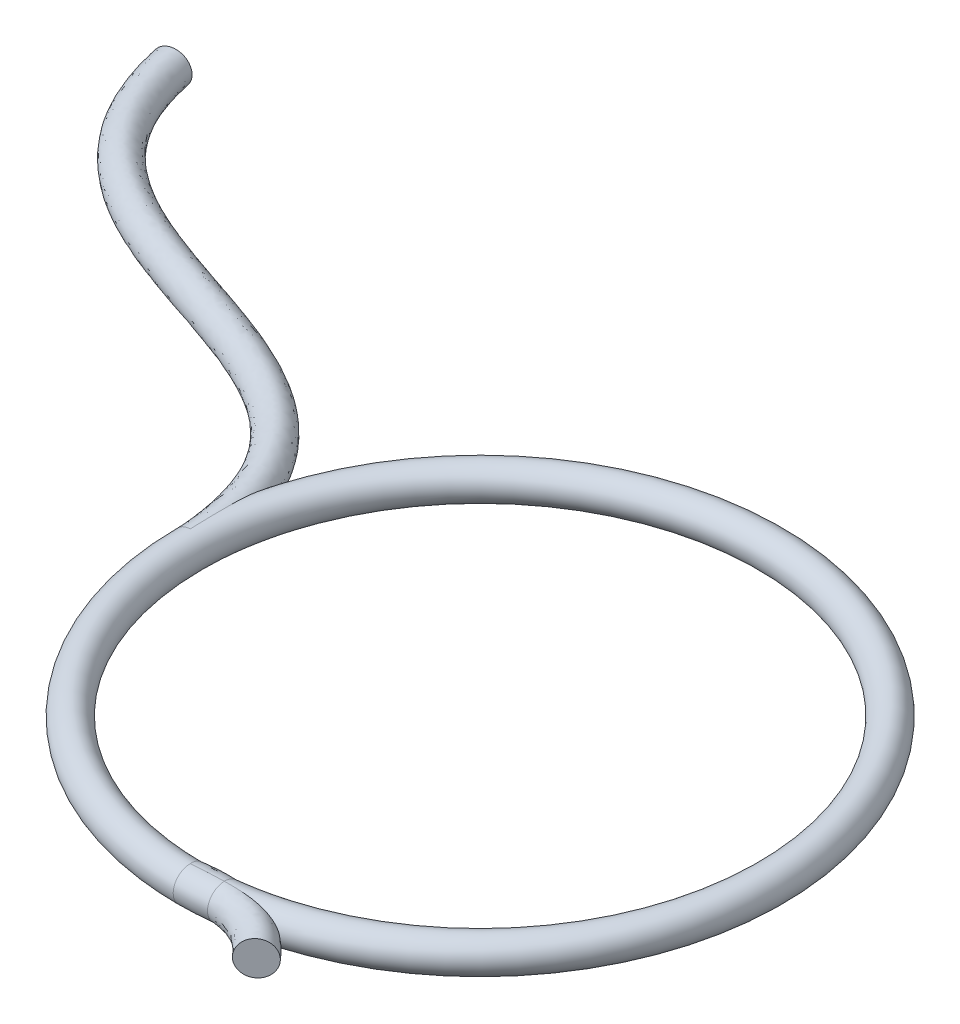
ISO-10303-21;
HEADER;
FILE_DESCRIPTION(('STEP AP214'),'2;1');
FILE_NAME('part.step','',(''),(''),'','','');
FILE_SCHEMA(('AUTOMOTIVE_DESIGN { 1 0 10303 214 1 1 1 1 }'));
ENDSEC;
DATA;
#1=APPLICATION_CONTEXT('core data for automotive mechanical design processes');
#2=APPLICATION_PROTOCOL_DEFINITION('international standard','automotive_design',2000,#1);
#3=PRODUCT_CONTEXT('',#1,'mechanical');
#4=PRODUCT('Part','Part','',(#3));
#5=PRODUCT_RELATED_PRODUCT_CATEGORY('part','',(#4));
#6=PRODUCT_DEFINITION_FORMATION('','',#4);
#7=PRODUCT_DEFINITION_CONTEXT('part definition',#1,'design');
#8=PRODUCT_DEFINITION('design','',#6,#7);
#9=PRODUCT_DEFINITION_SHAPE('','',#8);
#10=(LENGTH_UNIT() NAMED_UNIT(*) SI_UNIT(.MILLI.,.METRE.));
#11=(NAMED_UNIT(*) PLANE_ANGLE_UNIT() SI_UNIT($,.RADIAN.));
#12=(NAMED_UNIT(*) SI_UNIT($,.STERADIAN.) SOLID_ANGLE_UNIT());
#13=UNCERTAINTY_MEASURE_WITH_UNIT(LENGTH_MEASURE(1.E-05),#10,'distance_accuracy_value','');
#14=(GEOMETRIC_REPRESENTATION_CONTEXT(3) GLOBAL_UNCERTAINTY_ASSIGNED_CONTEXT((#13)) GLOBAL_UNIT_ASSIGNED_CONTEXT((#10,
#11,#12)) REPRESENTATION_CONTEXT('',''));
#15=CARTESIAN_POINT('',(0.,0.,0.));
#16=DIRECTION('',(0.,0.,1.));
#17=DIRECTION('',(1.,0.,0.));
#18=AXIS2_PLACEMENT_3D('',#15,#16,#17);
#19=CARTESIAN_POINT('',(0.,0.,0.));
#20=DIRECTION('',(0.,1.,0.));
#21=DIRECTION('',(0.,0.,1.));
#22=AXIS2_PLACEMENT_3D('',#19,#20,#21);
#23=TOROIDAL_SURFACE('',#22,21.59,1.27);
#24=CARTESIAN_POINT('',(0.,-1.27,21.59));
#25=CARTESIAN_POINT('',(0.00582413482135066,-1.26999998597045,21.5895154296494));
#26=CARTESIAN_POINT('',(0.0116483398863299,-1.26999970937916,21.5890316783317));
#27=CARTESIAN_POINT('',(0.227769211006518,-1.26998002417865,21.5711118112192));
#28=CARTESIAN_POINT('',(0.438157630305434,-1.26962984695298,21.5547517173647));
#29=CARTESIAN_POINT('',(0.85913494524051,-1.26908213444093,21.5248400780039));
#30=CARTESIAN_POINT('',(1.06972383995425,-1.26888459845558,21.5112885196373));
#31=CARTESIAN_POINT('',(1.49109422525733,-1.26895251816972,21.4877251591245));
#32=CARTESIAN_POINT('',(1.70187570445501,-1.26921794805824,21.4777131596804));
#33=CARTESIAN_POINT('',(2.01398454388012,-1.26965690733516,21.4660792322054));
#34=CARTESIAN_POINT('',(2.11525120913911,-1.26980648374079,21.4628013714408));
#35=CARTESIAN_POINT('',(2.27390930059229,-1.26995617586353,21.4585090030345));
#36=CARTESIAN_POINT('',(2.33129079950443,-1.26999297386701,21.4571293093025));
#37=CARTESIAN_POINT('',(2.394252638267,-1.26999969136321,21.4558129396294));
#38=CARTESIAN_POINT('',(2.39982935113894,-1.26999999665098,21.4556980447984));
#39=CARTESIAN_POINT('',(2.40540609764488,-1.27,21.4555848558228));
#40=B_SPLINE_CURVE_WITH_KNOTS('',3,(#24,#25,#26,#27,#28,#29,#30,#31,#32,#33,#34,#35,#36,#37,#38,
#39),.UNSPECIFIED.,.F.,.F.,(4,2,2,2,2,2,2,4),(0.,0.0175327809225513,0.650587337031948,
1.28363899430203,1.91665535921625,2.22060980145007,2.39280287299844,2.40953656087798),.UNSPECIFIED.);
#41=CARTESIAN_POINT('',(2.40540609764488,-1.27,21.4555848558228));
#42=VERTEX_POINT('',#41);
#43=CARTESIAN_POINT('',(0.,-1.27,21.59));
#44=VERTEX_POINT('',#43);
#45=EDGE_CURVE('E72',#42,#44,#40,.F.);
#46=ORIENTED_EDGE('',*,*,#45,.F.);
#47=CARTESIAN_POINT('',(2.40540609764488,-1.27,21.4555848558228));
#48=CARTESIAN_POINT('',(2.40552837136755,-1.27000024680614,21.4611604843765));
#49=CARTESIAN_POINT('',(2.40565030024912,-1.26996377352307,21.46673725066));
#50=CARTESIAN_POINT('',(2.40733554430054,-1.26894996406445,21.544050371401));
#51=CARTESIAN_POINT('',(2.4088401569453,-1.26194415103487,21.6158735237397));
#52=CARTESIAN_POINT('',(2.41097196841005,-1.24250246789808,21.7219061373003));
#53=CARTESIAN_POINT('',(2.41166272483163,-1.23451311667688,21.7570214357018));
#54=CARTESIAN_POINT('',(2.41300015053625,-1.21559835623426,21.8264899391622));
#55=CARTESIAN_POINT('',(2.41364678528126,-1.20467067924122,21.8608425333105));
#56=CARTESIAN_POINT('',(2.41551248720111,-1.16763366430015,21.9622001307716));
#57=CARTESIAN_POINT('',(2.41666103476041,-1.13723637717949,22.0276890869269));
#58=CARTESIAN_POINT('',(2.41875623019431,-1.06584474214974,22.1526203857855));
#59=CARTESIAN_POINT('',(2.41970287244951,-1.02485009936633,22.2120625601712));
#60=CARTESIAN_POINT('',(2.42097214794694,-0.956366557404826,22.2953344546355));
#61=CARTESIAN_POINT('',(2.42137006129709,-0.932378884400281,22.3221051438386));
#62=CARTESIAN_POINT('',(2.42211717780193,-0.882253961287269,22.373501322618));
#63=CARTESIAN_POINT('',(2.42246642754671,-0.856118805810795,22.3981288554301));
#64=CARTESIAN_POINT('',(2.42344424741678,-0.774697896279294,22.468576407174));
#65=CARTESIAN_POINT('',(2.42400314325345,-0.71638263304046,22.5109784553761));
#66=CARTESIAN_POINT('',(2.42494787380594,-0.593704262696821,22.5851476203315));
#67=CARTESIAN_POINT('',(2.42533439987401,-0.529366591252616,22.6169570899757));
#68=CARTESIAN_POINT('',(2.42595507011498,-0.396242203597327,22.6692800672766));
#69=CARTESIAN_POINT('',(2.42618922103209,-0.327455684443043,22.6897940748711));
#70=CARTESIAN_POINT('',(2.42651737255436,-0.187688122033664,22.7188565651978));
#71=CARTESIAN_POINT('',(2.42661192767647,-0.116716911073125,22.7274523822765));
#72=CARTESIAN_POINT('',(2.42666861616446,0.0256597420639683,22.7325825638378));
#73=CARTESIAN_POINT('',(2.42663075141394,0.0970651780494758,22.7291170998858));
#74=CARTESIAN_POINT('',(2.42642034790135,0.238137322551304,22.7102426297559));
#75=CARTESIAN_POINT('',(2.42624807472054,0.307807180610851,22.6948571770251));
#76=CARTESIAN_POINT('',(2.42575917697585,0.443573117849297,22.6526281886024));
#77=CARTESIAN_POINT('',(2.42544255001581,0.509669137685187,22.6257844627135));
#78=CARTESIAN_POINT('',(2.42464865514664,0.636532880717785,22.5613485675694));
#79=CARTESIAN_POINT('',(2.42417120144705,0.69729433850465,22.523743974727));
#80=CARTESIAN_POINT('',(2.42332303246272,0.783009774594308,22.4601780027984));
#81=CARTESIAN_POINT('',(2.42301825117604,0.810681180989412,22.4377919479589));
#82=CARTESIAN_POINT('',(2.42236237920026,0.86407960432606,22.3907607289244));
#83=CARTESIAN_POINT('',(2.42201124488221,0.889804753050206,22.3661134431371));
#84=CARTESIAN_POINT('',(2.4208838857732,0.96388422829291,22.2889114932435));
#85=CARTESIAN_POINT('',(2.42003497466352,1.00901076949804,22.2331946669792));
#86=CARTESIAN_POINT('',(2.41813759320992,1.08930113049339,22.114998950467));
#87=CARTESIAN_POINT('',(2.41708912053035,1.12446483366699,22.0525199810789));
#88=CARTESIAN_POINT('',(2.41536656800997,1.16913766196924,21.9548385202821));
#89=CARTESIAN_POINT('',(2.4147642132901,1.18272777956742,21.921450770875));
#90=CARTESIAN_POINT('',(2.41351276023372,1.20703473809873,21.8536829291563));
#91=CARTESIAN_POINT('',(2.41286370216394,1.21775401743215,21.8193037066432));
#92=CARTESIAN_POINT('',(2.4108512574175,1.24546120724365,21.7151027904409));
#93=CARTESIAN_POINT('',(2.40941955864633,1.25807767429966,21.6440441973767));
#94=CARTESIAN_POINT('',(2.40721674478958,1.26770659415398,21.5391968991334));
#95=CARTESIAN_POINT('',(2.40650100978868,1.26945362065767,21.5057632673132));
#96=CARTESIAN_POINT('',(2.40565031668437,1.2699634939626,21.4667382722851));
#97=CARTESIAN_POINT('',(2.40552838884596,1.26999994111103,21.4611615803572));
#98=CARTESIAN_POINT('',(2.40540609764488,1.27,21.4555848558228));
#99=B_SPLINE_CURVE_WITH_KNOTS('',3,(#47,#48,#49,#50,#51,#52,#53,#54,#55,#56,#57,#58,#59,#60,#61,
#62,#63,#64,#65,#66,#67,#68,#69,#70,#71,#72,#73,#74,#75,#76,#77,#78,#79,#80,#81,#82,#83,#84,#85,
#86,#87,#88,#89,#90,#91,#92,#93,#94,#95,#96,#97,#98),.UNSPECIFIED.,.F.,.F.,(4,2,2,2,2,2,2,2,2,2,
2,2,2,2,2,2,2,2,2,2,2,2,2,2,2,4),(0.,0.016734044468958,0.231969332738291,0.339932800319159,
0.447979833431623,0.663519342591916,0.879064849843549,0.986794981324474,1.09442125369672,
1.30960827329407,1.52392426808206,1.73823077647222,1.95168368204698,2.16513355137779,
2.37816272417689,2.59119543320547,2.80447509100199,2.91114957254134,3.01792518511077,
3.23196277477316,3.44600286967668,3.55404554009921,3.66199614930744,3.87733164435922,
3.9777091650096,3.99444320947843),.UNSPECIFIED.);
#100=CARTESIAN_POINT('',(2.40540609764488,1.27,21.4555848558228));
#101=VERTEX_POINT('',#100);
#102=EDGE_CURVE('E78',#101,#42,#99,.F.);
#103=ORIENTED_EDGE('',*,*,#102,.F.);
#104=CARTESIAN_POINT('',(0.,1.27,21.59));
#105=CARTESIAN_POINT('',(0.00582413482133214,1.26999998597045,21.5895154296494));
#106=CARTESIAN_POINT('',(0.0116483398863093,1.26999970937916,21.5890316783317));
#107=CARTESIAN_POINT('',(0.227769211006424,1.26998002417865,21.5711118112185));
#108=CARTESIAN_POINT('',(0.438157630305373,1.26962984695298,21.5547517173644));
#109=CARTESIAN_POINT('',(0.859134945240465,1.26908213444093,21.5248400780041));
#110=CARTESIAN_POINT('',(1.06972383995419,1.26888459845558,21.5112885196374));
#111=CARTESIAN_POINT('',(1.49109422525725,1.26895251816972,21.4877251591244));
#112=CARTESIAN_POINT('',(1.70187570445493,1.26921794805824,21.4777131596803));
#113=CARTESIAN_POINT('',(2.01398454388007,1.26965690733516,21.4660792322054));
#114=CARTESIAN_POINT('',(2.11525120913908,1.26980648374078,21.4628013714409));
#115=CARTESIAN_POINT('',(2.27390930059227,1.26995617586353,21.4585090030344));
#116=CARTESIAN_POINT('',(2.33129079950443,1.26999297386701,21.4571293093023));
#117=CARTESIAN_POINT('',(2.39425263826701,1.26999969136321,21.4558129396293));
#118=CARTESIAN_POINT('',(2.39982935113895,1.26999999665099,21.4556980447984));
#119=CARTESIAN_POINT('',(2.40540609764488,1.27,21.4555848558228));
#120=B_SPLINE_CURVE_WITH_KNOTS('',3,(#104,#105,#106,#107,#108,#109,#110,#111,#112,#113,#114,
#115,#116,#117,#118,#119),.UNSPECIFIED.,.F.,.F.,(4,2,2,2,2,2,2,4),(0.,0.0175327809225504,
0.650587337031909,1.28363899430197,1.91665535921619,2.22060980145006,2.39280287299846,
2.409536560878),.UNSPECIFIED.);
#121=CARTESIAN_POINT('',(0.,1.27,21.59));
#122=VERTEX_POINT('',#121);
#123=EDGE_CURVE('E156',#122,#101,#120,.T.);
#124=ORIENTED_EDGE('',*,*,#123,.F.);
#125=CARTESIAN_POINT('',(0.,0.,21.59));
#126=DIRECTION('',(1.,0.,0.));
#127=DIRECTION('',(0.,0.,-1.));
#128=AXIS2_PLACEMENT_3D('',#125,#126,#127);
#129=CIRCLE('',#128,1.27);
#130=EDGE_CURVE('E110',#122,#44,#129,.T.);
#131=ORIENTED_EDGE('',*,*,#130,.T.);
#132=EDGE_LOOP('',(#46,#103,#124,#131));
#133=FACE_BOUND('',#132,.T.);
#134=ADVANCED_FACE('F59',(#133),#23,.T.);
#135=CARTESIAN_POINT('',(0.,-1.27,21.59));
#136=CARTESIAN_POINT('',(-0.000484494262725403,-1.27000027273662,21.5841768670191));
#137=CARTESIAN_POINT('',(-0.000968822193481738,-1.26996018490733,21.5783524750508));
#138=CARTESIAN_POINT('',(-0.00738762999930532,-1.26889439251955,21.5011187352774));
#139=CARTESIAN_POINT('',(-0.013288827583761,-1.26185335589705,21.4296259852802));
#140=CARTESIAN_POINT('',(-0.0219431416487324,-1.24237160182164,21.3240837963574));
#141=CARTESIAN_POINT('',(-0.0247993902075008,-1.23437109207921,21.289131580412));
#142=CARTESIAN_POINT('',(-0.0304314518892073,-1.2154382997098,21.2199868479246));
#143=CARTESIAN_POINT('',(-0.0332072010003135,-1.20450375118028,21.185794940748));
#144=CARTESIAN_POINT('',(-0.0413708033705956,-1.16745243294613,21.0849129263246));
#145=CARTESIAN_POINT('',(-0.0466099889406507,-1.13705403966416,21.0197336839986));
#146=CARTESIAN_POINT('',(-0.0565467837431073,-1.0656787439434,20.8953989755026));
#147=CARTESIAN_POINT('',(-0.0612443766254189,-1.02470152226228,20.8362436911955));
#148=CARTESIAN_POINT('',(-0.0677920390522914,-0.95625874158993,20.7533757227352));
#149=CARTESIAN_POINT('',(-0.0698911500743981,-0.93228643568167,20.7267346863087));
#150=CARTESIAN_POINT('',(-0.0739114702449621,-0.882197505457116,20.6755882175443));
#151=CARTESIAN_POINT('',(-0.0758328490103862,-0.856082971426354,20.6510807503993));
#152=CARTESIAN_POINT('',(-0.0813170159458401,-0.774732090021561,20.5809768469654));
#153=CARTESIAN_POINT('',(-0.0846011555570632,-0.716474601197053,20.5387821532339));
#154=CARTESIAN_POINT('',(-0.0903303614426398,-0.593884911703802,20.4649407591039));
#155=CARTESIAN_POINT('',(-0.0927781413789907,-0.529573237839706,20.4332599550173));
#156=CARTESIAN_POINT('',(-0.0967967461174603,-0.396510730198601,20.3811425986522));
#157=CARTESIAN_POINT('',(-0.0983676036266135,-0.3277600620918,20.360705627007));
#158=CARTESIAN_POINT('',(-0.100593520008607,-0.187992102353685,20.3317213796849));
#159=CARTESIAN_POINT('',(-0.101251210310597,-0.11698192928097,20.3231399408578));
#160=CARTESIAN_POINT('',(-0.101645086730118,0.0254743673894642,20.3180024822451));
#161=CARTESIAN_POINT('',(-0.101381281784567,0.0969204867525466,20.3214463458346));
#162=CARTESIAN_POINT('',(-0.0999387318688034,0.238120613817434,20.3402491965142));
#163=CARTESIAN_POINT('',(-0.0987612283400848,0.307876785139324,20.3555920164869));
#164=CARTESIAN_POINT('',(-0.0955193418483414,0.44381240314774,20.3977207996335));
#165=CARTESIAN_POINT('',(-0.0934549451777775,0.509991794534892,20.4245069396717));
#166=CARTESIAN_POINT('',(-0.0884808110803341,0.636990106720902,20.4888068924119));
#167=CARTESIAN_POINT('',(-0.085570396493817,0.697804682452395,20.5263292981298));
#168=CARTESIAN_POINT('',(-0.0806271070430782,0.783589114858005,20.5897634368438));
#169=CARTESIAN_POINT('',(-0.0788827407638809,0.811281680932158,20.6121040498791));
#170=CARTESIAN_POINT('',(-0.0752089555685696,0.864717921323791,20.6590419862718));
#171=CARTESIAN_POINT('',(-0.0732793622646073,0.890459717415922,20.683641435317));
#172=CARTESIAN_POINT('',(-0.0672234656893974,0.964529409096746,20.7606433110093));
#173=CARTESIAN_POINT('',(-0.0628341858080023,1.00962969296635,20.8161959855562));
#174=CARTESIAN_POINT('',(-0.053465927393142,1.08985662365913,20.9340416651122));
#175=CARTESIAN_POINT('',(-0.048486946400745,1.12498322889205,20.996334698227));
#176=CARTESIAN_POINT('',(-0.040655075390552,1.16957206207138,21.093683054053));
#177=CARTESIAN_POINT('',(-0.037972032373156,1.18312381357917,21.1269295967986));
#178=CARTESIAN_POINT('',(-0.0325085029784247,1.20735727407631,21.1944080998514));
#179=CARTESIAN_POINT('',(-0.0297281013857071,1.21804141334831,21.2286391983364));
#180=CARTESIAN_POINT('',(-0.0212727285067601,1.24564820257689,21.3323864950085));
#181=CARTESIAN_POINT('',(-0.0154696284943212,1.25820458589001,21.4031304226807));
#182=CARTESIAN_POINT('',(-0.00689150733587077,1.26771092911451,21.5069875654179));
#183=CARTESIAN_POINT('',(-0.00417705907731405,1.26942913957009,21.5397499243));
#184=CARTESIAN_POINT('',(-0.00096891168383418,1.26995987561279,21.5783513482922));
#185=CARTESIAN_POINT('',(-0.000484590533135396,1.2699999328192,21.5841756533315));
#186=CARTESIAN_POINT('',(0.,1.27,21.59));
#187=B_SPLINE_CURVE_WITH_KNOTS('',3,(#135,#136,#137,#138,#139,#140,#141,#142,#143,#144,#145,
#146,#147,#148,#149,#150,#151,#152,#153,#154,#155,#156,#157,#158,#159,#160,#161,#162,#163,#164,
#165,#166,#167,#168,#169,#170,#171,#172,#173,#174,#175,#176,#177,#178,#179,#180,#181,#182,#183,
#184,#185,#186),.UNSPECIFIED.,.F.,.F.,(4,2,2,2,2,2,2,2,2,2,2,2,2,2,2,2,2,2,2,2,2,2,2,2,2,4),(0.,
0.0175331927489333,0.232474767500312,0.340289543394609,0.44818782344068,0.663431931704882,
0.878682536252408,0.986270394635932,1.09375449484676,1.30865817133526,1.52285779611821,
1.73704943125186,1.95062255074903,2.16419359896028,2.37747497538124,2.5907596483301,
2.80421550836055,2.9109775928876,3.01784119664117,3.23183376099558,3.44582721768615,
3.5537195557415,3.66152016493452,3.87655381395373,3.97523399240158,3.99276718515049),.UNSPECIFIED.);
#188=EDGE_CURVE('E12',#44,#122,#187,.T.);
#189=ORIENTED_EDGE('',*,*,#188,.F.);
#190=ORIENTED_EDGE('',*,*,#130,.F.);
#191=EDGE_LOOP('',(#189,#190));
#192=FACE_BOUND('',#191,.T.);
#193=CARTESIAN_POINT('',(2.40540609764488,-1.27,21.4555848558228));
#194=CARTESIAN_POINT('',(2.41098284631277,-1.27000000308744,21.4554716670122));
#195=CARTESIAN_POINT('',(2.41655962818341,-1.2699996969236,21.4553601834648));
#196=CARTESIAN_POINT('',(2.4520651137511,-1.26999569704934,21.4546613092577));
#197=CARTESIAN_POINT('',(2.4819947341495,-1.26998304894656,21.454121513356));
#198=CARTESIAN_POINT('',(2.6316503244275,-1.26986349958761,21.4516742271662));
#199=CARTESIAN_POINT('',(2.75139001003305,-1.2695876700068,21.4505219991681));
#200=CARTESIAN_POINT('',(2.99094731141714,-1.26831982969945,21.4499510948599));
#201=CARTESIAN_POINT('',(3.11076492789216,-1.26732735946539,21.4505335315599));
#202=CARTESIAN_POINT('',(3.35036217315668,-1.26415395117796,21.4535399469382));
#203=CARTESIAN_POINT('',(3.47014180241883,-1.26197302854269,21.4559639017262));
#204=CARTESIAN_POINT('',(3.70971137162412,-1.25582270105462,21.4627415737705));
#205=CARTESIAN_POINT('',(3.82950122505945,-1.25185169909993,21.4670970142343));
#206=CARTESIAN_POINT('',(4.06887976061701,-1.24138034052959,21.4777864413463));
#207=CARTESIAN_POINT('',(4.18846845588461,-1.23488015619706,21.4841202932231));
#208=CARTESIAN_POINT('',(4.43100748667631,-1.21817567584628,21.4990360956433));
#209=CARTESIAN_POINT('',(4.55394672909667,-1.20786249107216,21.507681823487));
#210=CARTESIAN_POINT('',(4.79914356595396,-1.18231675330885,21.5270981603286));
#211=CARTESIAN_POINT('',(4.92140127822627,-1.16708507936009,21.5378683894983));
#212=CARTESIAN_POINT('',(5.16480582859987,-1.13010191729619,21.5614206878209));
#213=CARTESIAN_POINT('',(5.28595219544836,-1.10834778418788,21.5742035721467));
#214=CARTESIAN_POINT('',(5.52616082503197,-1.05624750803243,21.6015475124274));
#215=CARTESIAN_POINT('',(5.64522489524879,-1.02590925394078,21.6161069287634));
#216=CARTESIAN_POINT('',(5.82149170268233,-0.971617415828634,21.6390235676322));
#217=CARTESIAN_POINT('',(5.88008474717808,-0.951961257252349,21.6468750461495));
#218=CARTESIAN_POINT('',(5.99595773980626,-0.909211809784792,21.6628348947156));
#219=CARTESIAN_POINT('',(6.05323819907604,-0.886119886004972,21.6709431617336));
#220=CARTESIAN_POINT('',(6.16575321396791,-0.835990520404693,21.6872672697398));
#221=CARTESIAN_POINT('',(6.22099545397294,-0.808970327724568,21.6954825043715));
#222=CARTESIAN_POINT('',(6.32887605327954,-0.750180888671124,21.7118783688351));
#223=CARTESIAN_POINT('',(6.38151670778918,-0.718415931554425,21.720059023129));
#224=CARTESIAN_POINT('',(6.47416561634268,-0.655235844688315,21.7347312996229));
#225=CARTESIAN_POINT('',(6.51477497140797,-0.624727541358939,21.7412684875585));
#226=CARTESIAN_POINT('',(6.57294221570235,-0.57562499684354,21.750759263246));
#227=CARTESIAN_POINT('',(6.59188039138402,-0.558693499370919,21.7538715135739));
#228=CARTESIAN_POINT('',(6.62869117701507,-0.523608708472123,21.7599590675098));
#229=CARTESIAN_POINT('',(6.64656133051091,-0.505452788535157,21.7629340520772));
#230=CARTESIAN_POINT('',(6.69860513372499,-0.44864946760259,21.7716483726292));
#231=CARTESIAN_POINT('',(6.73075864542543,-0.408037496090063,21.7771027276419));
#232=CARTESIAN_POINT('',(6.78713118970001,-0.321552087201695,21.7867454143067));
#233=CARTESIAN_POINT('',(6.81138183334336,-0.275700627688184,21.7909387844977));
#234=CARTESIAN_POINT('',(6.84272832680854,-0.195747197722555,21.7963843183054));
#235=CARTESIAN_POINT('',(6.85285018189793,-0.16286933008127,21.7981512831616));
#236=CARTESIAN_POINT('',(6.86753786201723,-0.0958544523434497,21.8007191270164));
#237=CARTESIAN_POINT('',(6.87210834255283,-0.0617185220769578,21.8015208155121));
#238=CARTESIAN_POINT('',(6.87527868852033,0.0069303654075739,21.8020766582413));
#239=CARTESIAN_POINT('',(6.87386327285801,0.0414440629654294,21.8018281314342));
#240=CARTESIAN_POINT('',(6.86516469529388,0.109701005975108,21.8003043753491));
#241=CARTESIAN_POINT('',(6.85787867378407,0.143443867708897,21.7990286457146));
#242=CARTESIAN_POINT('',(6.83830907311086,0.208502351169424,21.7956161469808));
#243=CARTESIAN_POINT('',(6.82614691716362,0.239856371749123,21.7935003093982));
#244=CARTESIAN_POINT('',(6.79762932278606,0.300573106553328,21.7885655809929));
#245=CARTESIAN_POINT('',(6.7812656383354,0.329931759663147,21.7857453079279));
#246=CARTESIAN_POINT('',(6.73317874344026,0.405187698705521,21.7775122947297));
#247=CARTESIAN_POINT('',(6.69847152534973,0.449122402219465,21.771621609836));
#248=CARTESIAN_POINT('',(6.62279644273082,0.531034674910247,21.7589596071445));
#249=CARTESIAN_POINT('',(6.58181360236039,0.568997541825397,21.75218618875));
#250=CARTESIAN_POINT('',(6.50105442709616,0.635217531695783,21.7390557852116));
#251=CARTESIAN_POINT('',(6.46176838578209,0.664094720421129,21.7327526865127));
#252=CARTESIAN_POINT('',(6.3809339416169,0.718281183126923,21.719986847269));
#253=CARTESIAN_POINT('',(6.33938858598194,0.743595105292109,21.7135243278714));
#254=CARTESIAN_POINT('',(6.25449396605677,0.791222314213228,21.7005451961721));
#255=CARTESIAN_POINT('',(6.21114033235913,0.813527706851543,21.6940284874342));
#256=CARTESIAN_POINT('',(6.12314376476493,0.855462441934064,21.6810485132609));
#257=CARTESIAN_POINT('',(6.07850041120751,0.875090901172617,21.6745852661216));
#258=CARTESIAN_POINT('',(5.9732798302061,0.918120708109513,21.6596607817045));
#259=CARTESIAN_POINT('',(5.91232619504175,0.940615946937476,21.6512474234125));
#260=CARTESIAN_POINT('',(5.78918310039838,0.982096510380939,21.6347554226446));
#261=CARTESIAN_POINT('',(5.72699313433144,1.00108036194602,21.6266769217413));
#262=CARTESIAN_POINT('',(5.53895096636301,1.05360519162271,21.6030546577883));
#263=CARTESIAN_POINT('',(5.4117659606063,1.08266569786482,21.5881440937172));
#264=CARTESIAN_POINT('',(5.15519108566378,1.13206330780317,21.5604003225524));
#265=CARTESIAN_POINT('',(5.02579577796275,1.15237417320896,21.5475734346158));
#266=CARTESIAN_POINT('',(4.76590196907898,1.18641085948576,21.5242529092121));
#267=CARTESIAN_POINT('',(4.63540302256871,1.20013387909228,21.5137602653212));
#268=CARTESIAN_POINT('',(4.30720067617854,1.22849005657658,21.4904876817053));
#269=CARTESIAN_POINT('',(4.10912954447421,1.24002522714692,21.4792657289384));
#270=CARTESIAN_POINT('',(3.71301792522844,1.25645657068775,21.4622798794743));
#271=CARTESIAN_POINT('',(3.5149785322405,1.26136880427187,21.4565027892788));
#272=CARTESIAN_POINT('',(3.21346807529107,1.26611901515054,21.451597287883));
#273=CARTESIAN_POINT('',(3.11003958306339,1.26726010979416,21.450610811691));
#274=CARTESIAN_POINT('',(2.90313692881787,1.26888186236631,21.4499617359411));
#275=CARTESIAN_POINT('',(2.7996627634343,1.26936229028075,21.4502995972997));
#276=CARTESIAN_POINT('',(2.60483550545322,1.26989398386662,21.4521138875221));
#277=CARTESIAN_POINT('',(2.51348115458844,1.26998889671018,21.4534524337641));
#278=CARTESIAN_POINT('',(2.41655962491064,1.26999968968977,21.4553601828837));
#279=CARTESIAN_POINT('',(2.41098284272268,1.26999999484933,21.4554716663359));
#280=CARTESIAN_POINT('',(2.40540609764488,1.27,21.4555848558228));
#281=B_SPLINE_CURVE_WITH_KNOTS('',3,(#193,#194,#195,#196,#197,#198,#199,#200,#201,#202,#203,
#204,#205,#206,#207,#208,#209,#210,#211,#212,#213,#214,#215,#216,#217,#218,#219,#220,#221,#222,
#223,#224,#225,#226,#227,#228,#229,#230,#231,#232,#233,#234,#235,#236,#237,#238,#239,#240,#241,
#242,#243,#244,#245,#246,#247,#248,#249,#250,#251,#252,#253,#254,#255,#256,#257,#258,#259,#260,
#261,#262,#263,#264,#265,#266,#267,#268,#269,#270,#271,#272,#273,#274,#275,#276,#277,#278,#279,
#280),.UNSPECIFIED.,.F.,.F.,(4,2,2,2,2,2,2,2,2,2,2,2,2,2,2,2,2,2,2,2,2,2,2,2,2,2,2,2,2,2,2,2,2,
2,2,2,2,2,2,2,2,2,2,4),(0.,0.0167336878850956,0.106537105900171,0.465759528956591,
0.825212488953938,1.18466078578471,1.54443041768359,1.90417554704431,2.27510634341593,
2.64597088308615,3.01698601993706,3.38766128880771,3.57447340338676,3.76121149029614,
3.94715307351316,4.13292757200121,4.28627368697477,4.36300699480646,4.43991048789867,
4.59547479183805,4.75040898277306,4.85332200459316,4.95614866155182,5.05923797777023,
5.16237753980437,5.26309415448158,5.36400996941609,5.53193443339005,5.70026605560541,
5.84754226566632,5.99462454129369,6.1420855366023,6.28959506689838,6.48600090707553,
6.6824889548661,7.07591531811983,7.47051340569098,7.86527913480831,8.4611580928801,
9.05558943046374,9.36589889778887,9.67631637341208,9.95040347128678,9.96713715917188),.UNSPECIFIED.);
#282=EDGE_CURVE('E157',#42,#101,#281,.T.);
#283=ORIENTED_EDGE('',*,*,#282,.F.);
#284=CARTESIAN_POINT('',(2.40540609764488,-1.27,21.4555848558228));
#285=CARTESIAN_POINT('',(2.40528383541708,-1.2700002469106,21.450009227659));
#286=CARTESIAN_POINT('',(2.40516117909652,-1.26996377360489,21.4444324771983));
#287=CARTESIAN_POINT('',(2.40345652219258,-1.26895045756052,21.3671587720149));
#288=CARTESIAN_POINT('',(2.40181243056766,-1.26195152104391,21.2953776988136));
#289=CARTESIAN_POINT('',(2.39930113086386,-1.24252587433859,21.1894102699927));
#290=CARTESIAN_POINT('',(2.39845511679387,-1.23454286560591,21.1543171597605));
#291=CARTESIAN_POINT('',(2.39675481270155,-1.21564220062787,21.0848936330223));
#292=CARTESIAN_POINT('',(2.39590051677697,-1.20472227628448,21.0505638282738));
#293=CARTESIAN_POINT('',(2.393342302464,-1.1677094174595,20.9492738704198));
#294=CARTESIAN_POINT('',(2.39163870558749,-1.13732973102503,20.8838305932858));
#295=CARTESIAN_POINT('',(2.38830782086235,-1.06597529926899,20.7589922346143));
#296=CARTESIAN_POINT('',(2.3866805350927,-1.02500026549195,20.699597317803));
#297=CARTESIAN_POINT('',(2.38435525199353,-0.956555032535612,20.6164036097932));
#298=CARTESIAN_POINT('',(2.38359966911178,-0.932585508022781,20.5896635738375));
#299=CARTESIAN_POINT('',(2.38213572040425,-0.882499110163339,20.5383266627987));
#300=CARTESIAN_POINT('',(2.38142730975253,-0.856384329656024,20.5137277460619));
#301=CARTESIAN_POINT('',(2.37938442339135,-0.775028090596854,20.4433618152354));
#302=CARTESIAN_POINT('',(2.37813181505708,-0.716760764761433,20.4010086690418));
#303=CARTESIAN_POINT('',(2.37591554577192,-0.59416657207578,20.3269053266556));
#304=CARTESIAN_POINT('',(2.37495083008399,-0.529862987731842,20.2951163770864));
#305=CARTESIAN_POINT('',(2.37335254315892,-0.396810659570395,20.2428147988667));
#306=CARTESIAN_POINT('',(2.3727189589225,-0.328062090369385,20.2223017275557));
#307=CARTESIAN_POINT('',(2.37181764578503,-0.188314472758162,20.1932041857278));
#308=CARTESIAN_POINT('',(2.37154875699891,-0.1173232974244,20.1845818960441));
#309=CARTESIAN_POINT('',(2.37138705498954,0.0250985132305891,20.1793908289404));
#310=CARTESIAN_POINT('',(2.37149423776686,0.0965291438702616,20.182821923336));
#311=CARTESIAN_POINT('',(2.3720786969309,0.237693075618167,20.2016265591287));
#312=CARTESIAN_POINT('',(2.37255542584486,0.307428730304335,20.2169824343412));
#313=CARTESIAN_POINT('',(2.3738532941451,0.443327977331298,20.2591626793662));
#314=CARTESIAN_POINT('',(2.37467443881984,0.509491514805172,20.2859872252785));
#315=CARTESIAN_POINT('',(2.37662085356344,0.636468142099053,20.3503909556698));
#316=CARTESIAN_POINT('',(2.3777463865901,0.697276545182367,20.3879794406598));
#317=CARTESIAN_POINT('',(2.3796179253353,0.783057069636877,20.4515315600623));
#318=CARTESIAN_POINT('',(2.38027243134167,0.810749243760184,20.4739146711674));
#319=CARTESIAN_POINT('',(2.38163546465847,0.864186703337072,20.520943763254));
#320=CARTESIAN_POINT('',(2.38234404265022,0.889930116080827,20.5455918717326));
#321=CARTESIAN_POINT('',(2.38454065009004,0.964020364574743,20.622761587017));
#322=CARTESIAN_POINT('',(2.38609764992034,1.00914107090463,20.6784446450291));
#323=CARTESIAN_POINT('',(2.38932088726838,1.08941664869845,20.7965774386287));
#324=CARTESIAN_POINT('',(2.39098712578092,1.12457142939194,20.8590272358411));
#325=CARTESIAN_POINT('',(2.39351948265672,1.16922352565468,20.9566580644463));
#326=CARTESIAN_POINT('',(2.39437307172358,1.18280405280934,20.9900224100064));
#327=CARTESIAN_POINT('',(2.39607986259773,1.20709291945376,21.0577438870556));
#328=CARTESIAN_POINT('',(2.39693306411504,1.21780369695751,21.0921001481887));
#329=CARTESIAN_POINT('',(2.3994776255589,1.2454876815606,21.1962331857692));
#330=CARTESIAN_POINT('',(2.40115846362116,1.25809159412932,21.2672475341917));
#331=CARTESIAN_POINT('',(2.4035509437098,1.26770923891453,21.3720254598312));
#332=CARTESIAN_POINT('',(2.40430087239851,1.26945395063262,21.4054325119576));
#333=CARTESIAN_POINT('',(2.40516115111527,1.26996349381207,21.4444314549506));
#334=CARTESIAN_POINT('',(2.40528380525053,1.26999994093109,21.4500081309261));
#335=CARTESIAN_POINT('',(2.40540609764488,1.27,21.4555848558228));
#336=B_SPLINE_CURVE_WITH_KNOTS('',3,(#284,#285,#286,#287,#288,#289,#290,#291,#292,#293,#294,
#295,#296,#297,#298,#299,#300,#301,#302,#303,#304,#305,#306,#307,#308,#309,#310,#311,#312,#313,
#314,#315,#316,#317,#318,#319,#320,#321,#322,#323,#324,#325,#326,#327,#328,#329,#330,#331,#332,
#333,#334,#335),.UNSPECIFIED.,.F.,.F.,(4,2,2,2,2,2,2,2,2,2,2,2,2,2,2,2,2,2,2,2,2,2,2,2,2,4),(0.,
0.0167340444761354,0.231852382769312,0.339756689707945,0.447744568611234,0.66317042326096,
0.878602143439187,0.986244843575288,1.09378375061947,1.3087964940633,1.52301155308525,
1.73721820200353,1.95074197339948,2.16426347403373,2.37746925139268,2.59067830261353,
2.80407213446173,2.91080335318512,3.01763586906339,3.23161866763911,3.44560341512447,
3.55358549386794,3.66147554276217,3.87669091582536,3.97699093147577,3.99372497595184),.UNSPECIFIED.);
#337=EDGE_CURVE('E85',#101,#42,#336,.F.);
#338=ORIENTED_EDGE('',*,*,#337,.F.);
#339=EDGE_LOOP('',(#283,#338));
#340=FACE_BOUND('',#339,.T.);
#341=CARTESIAN_POINT('',(-21.59,1.27,1.5836565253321E-13));
#342=CARTESIAN_POINT('',(-21.59030171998,1.2700000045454,-0.00935377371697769));
#343=CARTESIAN_POINT('',(-21.590602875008,1.26999989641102,-0.0187075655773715));
#344=CARTESIAN_POINT('',(-21.5922673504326,1.26999861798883,-0.0705017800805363));
#345=CARTESIAN_POINT('',(-21.5936197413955,1.26999504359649,-0.112942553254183));
#346=CARTESIAN_POINT('',(-21.6003275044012,1.26995983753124,-0.325148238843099));
#347=CARTESIAN_POINT('',(-21.6055202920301,1.26987620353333,-0.494918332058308));
#348=CARTESIAN_POINT('',(-21.6125589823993,1.26952891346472,-0.730933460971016));
#349=CARTESIAN_POINT('',(-21.6145147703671,1.26940614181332,-0.797175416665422));
#350=CARTESIAN_POINT('',(-21.6183916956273,1.2690904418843,-0.929638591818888));
#351=CARTESIAN_POINT('',(-21.6203128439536,1.26889753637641,-0.995859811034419));
#352=CARTESIAN_POINT('',(-21.62983927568,1.26771916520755,-1.32669957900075));
#353=CARTESIAN_POINT('',(-21.6372302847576,1.26609069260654,-1.59132453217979));
#354=CARTESIAN_POINT('',(-21.648252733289,1.26131753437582,-1.98858541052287));
#355=CARTESIAN_POINT('',(-21.6519209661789,1.25933394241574,-2.12123350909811));
#356=CARTESIAN_POINT('',(-21.6592780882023,1.25428324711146,-2.38647339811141));
#357=CARTESIAN_POINT('',(-21.6629669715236,1.25121643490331,-2.51906519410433));
#358=CARTESIAN_POINT('',(-21.6716966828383,1.24234704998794,-2.82994224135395));
#359=CARTESIAN_POINT('',(-21.6767648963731,1.23596568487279,-3.00821129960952));
#360=CARTESIAN_POINT('',(-21.6871355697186,1.21954073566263,-3.3646423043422));
#361=CARTESIAN_POINT('',(-21.6924381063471,1.2094959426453,-3.54280419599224));
#362=CARTESIAN_POINT('',(-21.7033904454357,1.18430201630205,-3.89913130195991));
#363=CARTESIAN_POINT('',(-21.7090409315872,1.16914255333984,-4.07729578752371));
#364=CARTESIAN_POINT('',(-21.7207426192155,1.13189277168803,-4.4320391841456));
#365=CARTESIAN_POINT('',(-21.726791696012,1.10983717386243,-4.6086215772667));
#366=CARTESIAN_POINT('',(-21.7362251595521,1.06945483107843,-4.87224113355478));
#367=CARTESIAN_POINT('',(-21.7394272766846,1.05479025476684,-4.95984498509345));
#368=CARTESIAN_POINT('',(-21.7459550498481,1.02253108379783,-5.13450257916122));
#369=CARTESIAN_POINT('',(-21.7492806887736,1.00493689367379,-5.22155639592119));
#370=CARTESIAN_POINT('',(-21.756043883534,0.966252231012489,-5.39462653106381));
#371=CARTESIAN_POINT('',(-21.759481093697,0.945171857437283,-5.48064509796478));
#372=CARTESIAN_POINT('',(-21.7664643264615,0.898659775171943,-5.65148018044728));
#373=CARTESIAN_POINT('',(-21.7700103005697,0.873229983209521,-5.7362972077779));
#374=CARTESIAN_POINT('',(-21.7758732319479,0.827142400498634,-5.87342326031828));
#375=CARTESIAN_POINT('',(-21.7781658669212,0.808135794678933,-5.92628711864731));
#376=CARTESIAN_POINT('',(-21.7827723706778,0.76746401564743,-6.03102866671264));
#377=CARTESIAN_POINT('',(-21.7850862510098,0.745797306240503,-6.08290576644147));
#378=CARTESIAN_POINT('',(-21.7897015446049,0.699390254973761,-6.18497848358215));
#379=CARTESIAN_POINT('',(-21.7920029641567,0.674665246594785,-6.2351810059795));
#380=CARTESIAN_POINT('',(-21.7965684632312,0.621369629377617,-6.33348064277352));
#381=CARTESIAN_POINT('',(-21.7988325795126,0.592803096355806,-6.38157991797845));
#382=CARTESIAN_POINT('',(-21.8026661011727,0.539216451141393,-6.46203568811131));
#383=CARTESIAN_POINT('',(-21.8042579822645,0.515322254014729,-6.49513547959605));
#384=CARTESIAN_POINT('',(-21.8073548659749,0.464427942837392,-6.55899785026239));
#385=CARTESIAN_POINT('',(-21.8088597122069,0.437422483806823,-6.58975625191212));
#386=CARTESIAN_POINT('',(-21.8117341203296,0.379495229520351,-6.64807590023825));
#387=CARTESIAN_POINT('',(-21.8131020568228,0.348534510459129,-6.67559928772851));
#388=CARTESIAN_POINT('',(-21.8155815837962,0.282491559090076,-6.725186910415));
#389=CARTESIAN_POINT('',(-21.8166939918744,0.247423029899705,-6.74726857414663));
#390=CARTESIAN_POINT('',(-21.818199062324,0.186391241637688,-6.77702694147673));
#391=CARTESIAN_POINT('',(-21.8187072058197,0.161577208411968,-6.7870375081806));
#392=CARTESIAN_POINT('',(-21.819513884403,0.110647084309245,-6.80290408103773));
#393=CARTESIAN_POINT('',(-21.8198126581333,0.0845325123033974,-6.80876481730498));
#394=CARTESIAN_POINT('',(-21.8201696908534,0.0315076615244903,-6.81576619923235));
#395=CARTESIAN_POINT('',(-21.8202265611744,0.00459367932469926,-6.81687959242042));
#396=CARTESIAN_POINT('',(-21.8200888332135,-0.0489878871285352,-6.81418032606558));
#397=CARTESIAN_POINT('',(-21.8198941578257,-0.075655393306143,-6.81036615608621));
#398=CARTESIAN_POINT('',(-21.8192975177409,-0.126140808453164,-6.79864980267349));
#399=CARTESIAN_POINT('',(-21.8189104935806,-0.150029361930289,-6.79104215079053));
#400=CARTESIAN_POINT('',(-21.8179703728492,-0.196504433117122,-6.77250816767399));
#401=CARTESIAN_POINT('',(-21.8174169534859,-0.219088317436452,-6.76157538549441));
#402=CARTESIAN_POINT('',(-21.8157708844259,-0.277157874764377,-6.72893729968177));
#403=CARTESIAN_POINT('',(-21.8145634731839,-0.311315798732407,-6.70488561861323));
#404=CARTESIAN_POINT('',(-21.8119236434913,-0.375560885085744,-6.65188702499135));
#405=CARTESIAN_POINT('',(-21.8104906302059,-0.405636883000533,-6.62292715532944));
#406=CARTESIAN_POINT('',(-21.8075986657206,-0.460163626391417,-6.56397660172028));
#407=CARTESIAN_POINT('',(-21.8061490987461,-0.4848639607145,-6.53421223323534));
#408=CARTESIAN_POINT('',(-21.8031812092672,-0.531602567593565,-6.47275304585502));
#409=CARTESIAN_POINT('',(-21.8016629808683,-0.553644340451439,-6.44106084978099));
#410=CARTESIAN_POINT('',(-21.7985811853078,-0.59555455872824,-6.37615869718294));
#411=CARTESIAN_POINT('',(-21.7970175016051,-0.6154166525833,-6.34294468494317));
#412=CARTESIAN_POINT('',(-21.7938683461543,-0.653220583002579,-6.27543921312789));
#413=CARTESIAN_POINT('',(-21.7922828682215,-0.671161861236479,-6.24114744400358));
#414=CARTESIAN_POINT('',(-21.7882867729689,-0.714184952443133,-6.15390228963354));
#415=CARTESIAN_POINT('',(-21.7858711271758,-0.738193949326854,-6.10042104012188));
#416=CARTESIAN_POINT('',(-21.7810520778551,-0.783112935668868,-5.99216099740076));
#417=CARTESIAN_POINT('',(-21.778648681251,-0.804021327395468,-5.93738155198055));
#418=CARTESIAN_POINT('',(-21.7738693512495,-0.843274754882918,-5.82682548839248));
#419=CARTESIAN_POINT('',(-21.7714934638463,-0.861615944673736,-5.7710475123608));
#420=CARTESIAN_POINT('',(-21.7667833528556,-0.896096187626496,-5.65880956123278));
#421=CARTESIAN_POINT('',(-21.7644491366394,-0.912234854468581,-5.60234946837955));
#422=CARTESIAN_POINT('',(-21.7574997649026,-0.957959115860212,-5.43172588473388));
#423=CARTESIAN_POINT('',(-21.7529583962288,-0.984691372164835,-5.31679361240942));
#424=CARTESIAN_POINT('',(-21.744099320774,-1.03237995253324,-5.08588419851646));
#425=CARTESIAN_POINT('',(-21.7397814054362,-1.05334174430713,-4.96990815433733));
#426=CARTESIAN_POINT('',(-21.731664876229,-1.08941407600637,-4.74563733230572));
#427=CARTESIAN_POINT('',(-21.7278512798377,-1.10483787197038,-4.63739274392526));
#428=CARTESIAN_POINT('',(-21.7203974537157,-1.13254531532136,-4.42049290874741));
#429=CARTESIAN_POINT('',(-21.7167572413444,-1.1448286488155,-4.31183762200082));
#430=CARTESIAN_POINT('',(-21.7060683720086,-1.17786839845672,-3.98535955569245));
#431=CARTESIAN_POINT('',(-21.6992557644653,-1.19479677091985,-3.76714416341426));
#432=CARTESIAN_POINT('',(-21.686108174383,-1.22177188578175,-3.33094937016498));
#433=CARTESIAN_POINT('',(-21.6797718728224,-1.23183830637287,-3.1129710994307));
#434=CARTESIAN_POINT('',(-21.667357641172,-1.24743563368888,-2.67683459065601));
#435=CARTESIAN_POINT('',(-21.6612797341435,-1.25296613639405,-2.45867633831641));
#436=CARTESIAN_POINT('',(-21.6488737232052,-1.26136237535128,-2.01132997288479));
#437=CARTESIAN_POINT('',(-21.6425484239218,-1.26407997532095,-1.7821393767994));
#438=CARTESIAN_POINT('',(-21.6297192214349,-1.26774800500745,-1.32371773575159));
#439=CARTESIAN_POINT('',(-21.6232152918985,-1.26869817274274,-1.09448668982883));
#440=CARTESIAN_POINT('',(-21.6124241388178,-1.26957606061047,-0.725720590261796));
#441=CARTESIAN_POINT('',(-21.6082652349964,-1.26975836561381,-0.586182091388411));
#442=CARTESIAN_POINT('',(-21.5997467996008,-1.26996854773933,-0.307114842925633));
#443=CARTESIAN_POINT('',(-21.5953872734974,-1.26999642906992,-0.167586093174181));
#444=CARTESIAN_POINT('',(-21.5906028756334,-1.26999988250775,-0.0187075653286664));
#445=CARTESIAN_POINT('',(-21.5903017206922,-1.26999998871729,-0.00935377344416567));
#446=CARTESIAN_POINT('',(-21.59,-1.27,1.65112912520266E-13));
#447=B_SPLINE_CURVE_WITH_KNOTS('',3,(#341,#342,#343,#344,#345,#346,#347,#348,#349,#350,#351,
#352,#353,#354,#355,#356,#357,#358,#359,#360,#361,#362,#363,#364,#365,#366,#367,#368,#369,#370,
#371,#372,#373,#374,#375,#376,#377,#378,#379,#380,#381,#382,#383,#384,#385,#386,#387,#388,#389,
#390,#391,#392,#393,#394,#395,#396,#397,#398,#399,#400,#401,#402,#403,#404,#405,#406,#407,#408,
#409,#410,#411,#412,#413,#414,#415,#416,#417,#418,#419,#420,#421,#422,#423,#424,#425,#426,#427,
#428,#429,#430,#431,#432,#433,#434,#435,#436,#437,#438,#439,#440,#441,#442,#443,#444,#445,#446),
.UNSPECIFIED.,.F.,.F.,(4,2,2,2,2,2,2,2,2,2,2,2,2,2,2,2,2,2,2,2,2,2,2,2,2,2,2,2,2,2,2,2,2,2,2,2,
2,2,2,2,2,2,2,2,2,2,2,2,2,2,2,2,4),(0.,0.0280759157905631,0.155462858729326,0.665010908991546,
0.86382363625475,1.06257187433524,1.85675908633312,2.25489668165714,2.65292735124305,
3.18826727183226,3.72378401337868,4.26038882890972,4.79433429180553,5.06093744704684,
5.32750381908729,5.59331109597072,5.85900153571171,6.0276171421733,6.19633058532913,
6.36423004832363,6.53195275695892,6.65437694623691,6.77701468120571,6.90096871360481,
7.02452043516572,7.10450950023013,7.18440724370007,7.26476303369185,7.34514346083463,
7.42007704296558,7.49515693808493,7.61981348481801,7.74480438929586,7.86074873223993,
7.97653871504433,8.09265761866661,8.20881018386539,8.38469636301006,8.56067286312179,
8.73691023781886,8.91317848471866,9.26721671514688,9.62091831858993,9.9490743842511,
10.2772632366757,10.9340034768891,11.5888523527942,12.2437595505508,12.9316301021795,
13.619602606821,14.0384042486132,14.4571944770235,14.4852703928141),.UNSPECIFIED.);
#448=CARTESIAN_POINT('',(-21.59,1.27,0.));
#449=VERTEX_POINT('',#448);
#450=CARTESIAN_POINT('',(-21.59,-1.27,1.65112912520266E-13));
#451=VERTEX_POINT('',#450);
#452=EDGE_CURVE('E122',#449,#451,#447,.T.);
#453=ORIENTED_EDGE('',*,*,#452,.F.);
#454=CARTESIAN_POINT('',(-21.59,1.27,1.5836565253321E-13));
#455=CARTESIAN_POINT('',(-21.5993515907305,1.2700007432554,0.000301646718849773));
#456=CARTESIAN_POINT('',(-21.6087063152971,1.26989729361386,0.000603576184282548));
#457=CARTESIAN_POINT('',(-21.6893258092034,1.2681104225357,0.00320716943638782));
#458=CARTESIAN_POINT('',(-21.760605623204,1.26050166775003,0.00551957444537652));
#459=CARTESIAN_POINT('',(-21.8657527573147,1.24022034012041,0.00894548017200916));
#460=CARTESIAN_POINT('',(-21.9005582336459,1.23196241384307,0.010082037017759));
#461=CARTESIAN_POINT('',(-21.9693843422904,1.21253576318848,0.0123342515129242));
#462=CARTESIAN_POINT('',(-22.0034043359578,1.20136475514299,0.0134498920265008));
#463=CARTESIAN_POINT('',(-22.1037356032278,1.16364154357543,0.0167468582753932));
#464=CARTESIAN_POINT('',(-22.1685013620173,1.13284360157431,0.0188842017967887));
#465=CARTESIAN_POINT('',(-22.291938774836,1.06078868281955,0.0229725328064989));
#466=CARTESIAN_POINT('',(-22.3506101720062,1.01953126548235,0.0249235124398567));
#467=CARTESIAN_POINT('',(-22.4327629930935,0.950738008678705,0.0276637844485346));
#468=CARTESIAN_POINT('',(-22.4591838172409,0.926641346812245,0.0285465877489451));
#469=CARTESIAN_POINT('',(-22.5098791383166,0.876332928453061,0.0302429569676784));
#470=CARTESIAN_POINT('',(-22.5341556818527,0.850123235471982,0.0310565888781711));
#471=CARTESIAN_POINT('',(-22.6035568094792,0.768532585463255,0.0333856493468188));
#472=CARTESIAN_POINT('',(-22.6452689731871,0.710176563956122,0.0347897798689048));
#473=CARTESIAN_POINT('',(-22.7182576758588,0.587344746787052,0.0372513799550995));
#474=CARTESIAN_POINT('',(-22.7495398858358,0.52287230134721,0.0383090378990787));
#475=CARTESIAN_POINT('',(-22.8008424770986,0.389579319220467,0.0400456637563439));
#476=CARTESIAN_POINT('',(-22.8208630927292,0.320758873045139,0.0407246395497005));
#477=CARTESIAN_POINT('',(-22.8490575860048,0.180763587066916,0.0416812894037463));
#478=CARTESIAN_POINT('',(-22.8572366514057,0.109589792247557,0.0419591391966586));
#479=CARTESIAN_POINT('',(-22.8615347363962,-0.0331214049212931,0.0421051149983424));
#480=CARTESIAN_POINT('',(-22.8576537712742,-0.10465880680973,0.0419732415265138));
#481=CARTESIAN_POINT('',(-22.8379415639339,-0.246052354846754,0.0413040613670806));
#482=CARTESIAN_POINT('',(-22.8221128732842,-0.315908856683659,0.0407668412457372));
#483=CARTESIAN_POINT('',(-22.7789670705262,-0.451965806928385,0.039304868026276));
#484=CARTESIAN_POINT('',(-22.7516497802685,-0.51816619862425,0.0383801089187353));
#485=CARTESIAN_POINT('',(-22.6862666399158,-0.645078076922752,0.0361717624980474));
#486=CARTESIAN_POINT('',(-22.6481989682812,-0.705788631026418,0.0348881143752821));
#487=CARTESIAN_POINT('',(-22.5839311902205,-0.791347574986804,0.032727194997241));
#488=CARTESIAN_POINT('',(-22.5613102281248,-0.818953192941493,0.031967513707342));
#489=CARTESIAN_POINT('',(-22.5138065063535,-0.872191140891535,0.0303745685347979));
#490=CARTESIAN_POINT('',(-22.4889215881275,-0.897821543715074,0.0295412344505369));
#491=CARTESIAN_POINT('',(-22.4111411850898,-0.971437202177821,0.0269407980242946));
#492=CARTESIAN_POINT('',(-22.3551035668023,-1.01616881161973,0.0250727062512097));
#493=CARTESIAN_POINT('',(-22.2363129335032,-1.09556883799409,0.0211278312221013));
#494=CARTESIAN_POINT('',(-22.1735601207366,-1.13023755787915,0.0190510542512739));
#495=CARTESIAN_POINT('',(-22.0757457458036,-1.17397971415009,0.0158273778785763));
#496=CARTESIAN_POINT('',(-22.0424835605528,-1.18719476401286,0.0147333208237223));
#497=CARTESIAN_POINT('',(-21.9749980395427,-1.21076487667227,0.0125182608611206));
#498=CARTESIAN_POINT('',(-21.9407755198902,-1.22112229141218,0.0113972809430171));
#499=CARTESIAN_POINT('',(-21.837095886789,-1.24776293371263,0.00800861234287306));
#500=CARTESIAN_POINT('',(-21.7664417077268,-1.25969709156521,0.00570909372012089));
#501=CARTESIAN_POINT('',(-21.669664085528,-1.26776393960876,0.00257353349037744));
#502=CARTESIAN_POINT('',(-21.6438718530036,-1.26912001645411,0.0017392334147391));
#503=CARTESIAN_POINT('',(-21.6087094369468,-1.26989644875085,0.000603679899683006));
#504=CARTESIAN_POINT('',(-21.5993551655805,-1.26999974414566,0.000301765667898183));
#505=CARTESIAN_POINT('',(-21.59,-1.27,1.65112912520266E-13));
#506=B_SPLINE_CURVE_WITH_KNOTS('',3,(#454,#455,#456,#457,#458,#459,#460,#461,#462,#463,#464,
#465,#466,#467,#468,#469,#470,#471,#472,#473,#474,#475,#476,#477,#478,#479,#480,#481,#482,#483,
#484,#485,#486,#487,#488,#489,#490,#491,#492,#493,#494,#495,#496,#497,#498,#499,#500,#501,#502,
#503,#504,#505),.UNSPECIFIED.,.F.,.F.,(4,2,2,2,2,2,2,2,2,2,2,2,2,2,2,2,2,2,2,2,2,2,2,2,2,4),(0.,
0.0280776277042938,0.241967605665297,0.349241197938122,0.45659913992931,0.670762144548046,
0.884934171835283,0.99213218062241,1.09922674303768,1.3133536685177,1.52736397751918,
1.74136983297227,1.95528190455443,2.16919370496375,2.38305983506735,2.59692928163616,
2.81083498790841,2.91782043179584,3.02490897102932,3.23900484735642,3.45309427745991,
3.56040336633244,3.66762387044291,3.88146416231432,3.95895660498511,3.98703423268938),.UNSPECIFIED.);
#507=EDGE_CURVE('E115',#451,#449,#506,.F.);
#508=ORIENTED_EDGE('',*,*,#507,.F.);
#509=EDGE_LOOP('',(#453,#508));
#510=FACE_BOUND('',#509,.T.);
#511=ADVANCED_FACE('F61',(#192,#340,#510),#23,.T.);
#512=CARTESIAN_POINT('',(-53.3302808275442,0.,-30.3725526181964));
#513=DIRECTION('',(-0.204932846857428,0.,-0.978776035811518));
#514=DIRECTION('',(-0.978776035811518,0.,0.204932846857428));
#515=AXIS2_PLACEMENT_3D('',#512,#513,#514);
#516=PLANE('',#515);
#517=CARTESIAN_POINT('',(-53.3302808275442,0.,-30.3725526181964));
#518=DIRECTION('',(-0.204932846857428,0.,-0.978776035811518));
#519=DIRECTION('',(-0.978776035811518,0.,0.204932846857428));
#520=AXIS2_PLACEMENT_3D('',#517,#518,#519);
#521=CIRCLE('',#520,1.27);
#522=CARTESIAN_POINT('',(-54.5733263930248,0.,-30.1122879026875));
#523=VERTEX_POINT('',#522);
#524=EDGE_CURVE('E108',#523,#523,#521,.T.);
#525=ORIENTED_EDGE('',*,*,#524,.T.);
#526=EDGE_LOOP('',(#525));
#527=FACE_BOUND('',#526,.T.);
#528=ADVANCED_FACE('F133',(#527),#516,.T.);
#529=CARTESIAN_POINT('',(-22.8573599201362,0.,0.0818463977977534));
#530=CARTESIAN_POINT('',(-23.0247904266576,0.,-2.51075043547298));
#531=CARTESIAN_POINT('',(-23.5571828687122,0.,-4.56365845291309));
#532=CARTESIAN_POINT('',(-25.1279975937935,0.,-7.9037696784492));
#533=CARTESIAN_POINT('',(-26.1660289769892,0.,-9.20111032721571));
#534=CARTESIAN_POINT('',(-29.9058334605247,0.,-12.4535309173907));
#535=CARTESIAN_POINT('',(-33.2874198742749,0.,-13.7428963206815));
#536=CARTESIAN_POINT('',(-40.5019842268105,0.,-16.2050598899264));
#537=CARTESIAN_POINT('',(-44.3190284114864,0.,-17.3736742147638));
#538=CARTESIAN_POINT('',(-49.2161970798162,0.,-20.6500225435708));
#539=CARTESIAN_POINT('',(-50.7069454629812,0.,-22.0056909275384));
#540=CARTESIAN_POINT('',(-53.1229582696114,0.,-25.4699010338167));
#541=CARTESIAN_POINT('',(-54.0412960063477,0.,-27.5712672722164));
#542=CARTESIAN_POINT('',(-54.5733263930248,0.,-30.1122879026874));
#543=CARTESIAN_POINT('',(-22.8573599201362,2.54,0.0818463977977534));
#544=CARTESIAN_POINT('',(-23.0247904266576,2.54,-2.51075043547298));
#545=CARTESIAN_POINT('',(-23.5571828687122,2.54,-4.56365845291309));
#546=CARTESIAN_POINT('',(-25.1279975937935,2.54,-7.9037696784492));
#547=CARTESIAN_POINT('',(-26.1660289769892,2.54,-9.20111032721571));
#548=CARTESIAN_POINT('',(-29.9058334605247,2.54,-12.4535309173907));
#549=CARTESIAN_POINT('',(-33.2874198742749,2.54,-13.7428963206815));
#550=CARTESIAN_POINT('',(-40.5019842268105,2.54,-16.2050598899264));
#551=CARTESIAN_POINT('',(-44.3190284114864,2.54,-17.3736742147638));
#552=CARTESIAN_POINT('',(-49.2161970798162,2.54,-20.6500225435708));
#553=CARTESIAN_POINT('',(-50.7069454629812,2.54,-22.0056909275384));
#554=CARTESIAN_POINT('',(-53.1229582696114,2.54,-25.4699010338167));
#555=CARTESIAN_POINT('',(-54.0412960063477,2.54,-27.5712672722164));
#556=CARTESIAN_POINT('',(-54.5733263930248,2.54,-30.1122879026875));
#557=CARTESIAN_POINT('',(-20.3226400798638,2.54,-0.0818463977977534));
#558=CARTESIAN_POINT('',(-20.5069119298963,2.54,-2.9352249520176));
#559=CARTESIAN_POINT('',(-21.1049147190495,2.54,-5.31766337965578));
#560=CARTESIAN_POINT('',(-22.9832553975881,2.54,-9.31168424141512));
#561=CARTESIAN_POINT('',(-24.2639841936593,2.54,-10.9131292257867));
#562=CARTESIAN_POINT('',(-28.709476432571,2.54,-14.7792699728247));
#563=CARTESIAN_POINT('',(-32.4234427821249,2.54,-16.1318846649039));
#564=CARTESIAN_POINT('',(-39.725193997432,2.54,-18.6238030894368));
#565=CARTESIAN_POINT('',(-43.3289126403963,2.54,-19.7672906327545));
#566=CARTESIAN_POINT('',(-47.5926708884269,2.54,-22.6198689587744));
#567=CARTESIAN_POINT('',(-48.8271952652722,2.54,-23.7506384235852));
#568=CARTESIAN_POINT('',(-50.8359680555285,2.54,-26.6309257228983));
#569=CARTESIAN_POINT('',(-51.6171431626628,2.54,-28.3876190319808));
#570=CARTESIAN_POINT('',(-52.0872352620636,2.54,-30.6328173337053));
#571=CARTESIAN_POINT('',(-20.3226400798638,0.,-0.0818463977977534));
#572=CARTESIAN_POINT('',(-20.5069119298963,0.,-2.9352249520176));
#573=CARTESIAN_POINT('',(-21.1049147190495,0.,-5.31766337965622));
#574=CARTESIAN_POINT('',(-22.9832553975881,0.,-9.31168424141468));
#575=CARTESIAN_POINT('',(-24.2639841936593,0.,-10.9131292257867));
#576=CARTESIAN_POINT('',(-28.709476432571,0.,-14.7792699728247));
#577=CARTESIAN_POINT('',(-32.4234427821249,0.,-16.1318846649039));
#578=CARTESIAN_POINT('',(-39.725193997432,0.,-18.6238030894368));
#579=CARTESIAN_POINT('',(-43.3289126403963,0.,-19.7672906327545));
#580=CARTESIAN_POINT('',(-47.5926708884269,0.,-22.6198689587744));
#581=CARTESIAN_POINT('',(-48.8271952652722,0.,-23.7506384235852));
#582=CARTESIAN_POINT('',(-50.8359680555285,0.,-26.6309257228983));
#583=CARTESIAN_POINT('',(-51.6171431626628,0.,-28.3876190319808));
#584=CARTESIAN_POINT('',(-52.0872352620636,0.,-30.6328173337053));
#585=CARTESIAN_POINT('',(-20.3226400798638,-2.54,-0.0818463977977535));
#586=CARTESIAN_POINT('',(-20.5069119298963,-2.54,-2.9352249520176));
#587=CARTESIAN_POINT('',(-21.1049147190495,-2.54,-5.31766337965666));
#588=CARTESIAN_POINT('',(-22.9832553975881,-2.54,-9.31168424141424));
#589=CARTESIAN_POINT('',(-24.2639841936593,-2.54,-10.9131292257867));
#590=CARTESIAN_POINT('',(-28.709476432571,-2.54,-14.7792699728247));
#591=CARTESIAN_POINT('',(-32.4234427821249,-2.54,-16.1318846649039));
#592=CARTESIAN_POINT('',(-39.725193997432,-2.54,-18.6238030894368));
#593=CARTESIAN_POINT('',(-43.3289126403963,-2.54,-19.7672906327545));
#594=CARTESIAN_POINT('',(-47.5926708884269,-2.54,-22.6198689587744));
#595=CARTESIAN_POINT('',(-48.8271952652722,-2.54,-23.7506384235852));
#596=CARTESIAN_POINT('',(-50.8359680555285,-2.54,-26.6309257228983));
#597=CARTESIAN_POINT('',(-51.6171431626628,-2.54,-28.3876190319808));
#598=CARTESIAN_POINT('',(-52.0872352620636,-2.54,-30.6328173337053));
#599=CARTESIAN_POINT('',(-22.8573599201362,-2.54,0.0818463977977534));
#600=CARTESIAN_POINT('',(-23.0247904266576,-2.54,-2.51075043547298));
#601=CARTESIAN_POINT('',(-23.5571828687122,-2.54,-4.56365845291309));
#602=CARTESIAN_POINT('',(-25.1279975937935,-2.54,-7.9037696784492));
#603=CARTESIAN_POINT('',(-26.1660289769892,-2.54,-9.20111032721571));
#604=CARTESIAN_POINT('',(-29.9058334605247,-2.54,-12.4535309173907));
#605=CARTESIAN_POINT('',(-33.2874198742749,-2.54,-13.7428963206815));
#606=CARTESIAN_POINT('',(-40.5019842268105,-2.54,-16.2050598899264));
#607=CARTESIAN_POINT('',(-44.3190284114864,-2.54,-17.3736742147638));
#608=CARTESIAN_POINT('',(-49.2161970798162,-2.54,-20.6500225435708));
#609=CARTESIAN_POINT('',(-50.7069454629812,-2.54,-22.0056909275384));
#610=CARTESIAN_POINT('',(-53.1229582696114,-2.54,-25.4699010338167));
#611=CARTESIAN_POINT('',(-54.0412960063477,-2.54,-27.5712672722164));
#612=CARTESIAN_POINT('',(-54.5733263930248,-2.54,-30.1122879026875));
#613=CARTESIAN_POINT('',(-22.8573599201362,0.,0.0818463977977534));
#614=CARTESIAN_POINT('',(-23.0247904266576,0.,-2.51075043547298));
#615=CARTESIAN_POINT('',(-23.5571828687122,0.,-4.56365845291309));
#616=CARTESIAN_POINT('',(-25.1279975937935,0.,-7.9037696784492));
#617=CARTESIAN_POINT('',(-26.1660289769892,0.,-9.20111032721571));
#618=CARTESIAN_POINT('',(-29.9058334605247,0.,-12.4535309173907));
#619=CARTESIAN_POINT('',(-33.2874198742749,0.,-13.7428963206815));
#620=CARTESIAN_POINT('',(-40.5019842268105,0.,-16.2050598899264));
#621=CARTESIAN_POINT('',(-44.3190284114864,0.,-17.3736742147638));
#622=CARTESIAN_POINT('',(-49.2161970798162,0.,-20.6500225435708));
#623=CARTESIAN_POINT('',(-50.7069454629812,0.,-22.0056909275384));
#624=CARTESIAN_POINT('',(-53.1229582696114,0.,-25.4699010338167));
#625=CARTESIAN_POINT('',(-54.0412960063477,0.,-27.5712672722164));
#626=CARTESIAN_POINT('',(-54.5733263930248,0.,-30.1122879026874));
#627=(BOUNDED_SURFACE() B_SPLINE_SURFACE(3,3,((#529,#530,#531,#532,#533,#534,#535,#536,#537,
#538,#539,#540,#541,#542),(#543,#544,#545,#546,#547,#548,#549,#550,#551,#552,#553,#554,#555,
#556),(#557,#558,#559,#560,#561,#562,#563,#564,#565,#566,#567,#568,#569,#570),(#571,#572,#573,
#574,#575,#576,#577,#578,#579,#580,#581,#582,#583,#584),(#585,#586,#587,#588,#589,#590,#591,
#592,#593,#594,#595,#596,#597,#598),(#599,#600,#601,#602,#603,#604,#605,#606,#607,#608,#609,
#610,#611,#612),(#613,#614,#615,#616,#617,#618,#619,#620,#621,#622,#623,#624,#625,#626)),
.UNSPECIFIED.,.T.,.F.,.F.) B_SPLINE_SURFACE_WITH_KNOTS((4,3,4),(4,2,2,2,2,2,4),(0.,0.5,1.),(0.,
0.125,0.25,0.5,0.75,0.875,1.),
.UNSPECIFIED.) GEOMETRIC_REPRESENTATION_ITEM() RATIONAL_B_SPLINE_SURFACE(((1.,1.,1.,1.,1.,1.,1.,
1.,1.,1.,1.,1.,1.,1.),(0.333333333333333,0.333333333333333,0.333333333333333,0.333333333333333,
0.333333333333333,0.333333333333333,0.333333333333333,0.333333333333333,0.333333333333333,
0.333333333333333,0.333333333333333,0.333333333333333,0.333333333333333,0.333333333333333),
(0.333333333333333,0.333333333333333,0.333333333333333,0.333333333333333,0.333333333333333,
0.333333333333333,0.333333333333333,0.333333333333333,0.333333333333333,0.333333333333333,
0.333333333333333,0.333333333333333,0.333333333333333,0.333333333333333),(1.,1.,1.,1.,1.,1.,1.,
1.,1.,1.,1.,1.,1.,1.),(0.333333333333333,0.333333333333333,0.333333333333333,0.333333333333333,
0.333333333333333,0.333333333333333,0.333333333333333,0.333333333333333,0.333333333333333,
0.333333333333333,0.333333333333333,0.333333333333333,0.333333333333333,0.333333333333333),
(0.333333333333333,0.333333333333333,0.333333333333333,0.333333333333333,0.333333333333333,
0.333333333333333,0.333333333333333,0.333333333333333,0.333333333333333,0.333333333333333,
0.333333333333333,0.333333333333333,0.333333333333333,0.333333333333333),(1.,1.,1.,1.,1.,1.,1.,
1.,1.,1.,1.,1.,1.,1.))) REPRESENTATION_ITEM('') SURFACE());
#628=ORIENTED_EDGE('',*,*,#524,.F.);
#629=EDGE_LOOP('',(#628));
#630=FACE_BOUND('',#629,.T.);
#631=ORIENTED_EDGE('',*,*,#507,.T.);
#632=ORIENTED_EDGE('',*,*,#452,.T.);
#633=EDGE_LOOP('',(#631,#632));
#634=FACE_BOUND('',#633,.T.);
#635=ADVANCED_FACE('F127',(#630,#634),#627,.T.);
#636=CARTESIAN_POINT('',(7.29573724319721,0.,23.962918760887));
#637=DIRECTION('',(0.637524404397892,0.,0.770430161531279));
#638=DIRECTION('',(0.770430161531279,0.,-0.637524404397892));
#639=AXIS2_PLACEMENT_3D('',#636,#637,#638);
#640=PLANE('',#639);
#641=CARTESIAN_POINT('',(7.29573724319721,0.,23.962918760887));
#642=DIRECTION('',(0.637524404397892,0.,0.770430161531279));
#643=DIRECTION('',(0.770430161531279,0.,-0.637524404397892));
#644=AXIS2_PLACEMENT_3D('',#641,#642,#643);
#645=CIRCLE('',#644,1.27);
#646=CARTESIAN_POINT('',(8.27418354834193,0.,23.1532627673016));
#647=VERTEX_POINT('',#646);
#648=EDGE_CURVE('E105',#647,#647,#645,.T.);
#649=ORIENTED_EDGE('',*,*,#648,.T.);
#650=EDGE_LOOP('',(#649));
#651=FACE_BOUND('',#650,.T.);
#652=ADVANCED_FACE('F106',(#651),#640,.T.);
#653=CARTESIAN_POINT('',(-0.209877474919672,0.,20.3374619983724));
#654=CARTESIAN_POINT('',(1.50697773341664,0.,20.0497827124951));
#655=CARTESIAN_POINT('',(3.11190053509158,0.,20.1127734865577));
#656=CARTESIAN_POINT('',(6.00444767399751,0.,21.0535666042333));
#657=CARTESIAN_POINT('',(7.26796631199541,0.,21.9372777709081));
#658=CARTESIAN_POINT('',(8.27418354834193,0.,23.1532627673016));
#659=CARTESIAN_POINT('',(-0.209877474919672,2.54,20.3374619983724));
#660=CARTESIAN_POINT('',(1.50697773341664,2.54,20.0497827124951));
#661=CARTESIAN_POINT('',(3.11190053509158,2.54,20.1127734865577));
#662=CARTESIAN_POINT('',(6.00444767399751,2.54,21.0535666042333));
#663=CARTESIAN_POINT('',(7.26796631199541,2.54,21.9372777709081));
#664=CARTESIAN_POINT('',(8.27418354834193,2.54,23.1532627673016));
#665=CARTESIAN_POINT('',(0.20987747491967,2.54,22.8425380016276));
#666=CARTESIAN_POINT('',(1.61492942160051,2.54,22.6071050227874));
#667=CARTESIAN_POINT('',(2.78691640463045,2.54,22.67804457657));
#668=CARTESIAN_POINT('',(4.75819409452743,2.54,23.3191972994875));
#669=CARTESIAN_POINT('',(5.58159050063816,2.54,23.8835016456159));
#670=CARTESIAN_POINT('',(6.31729093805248,2.54,24.7725747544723));
#671=CARTESIAN_POINT('',(0.20987747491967,0.,22.8425380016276));
#672=CARTESIAN_POINT('',(1.61492942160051,0.,22.6071050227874));
#673=CARTESIAN_POINT('',(2.78691640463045,0.,22.67804457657));
#674=CARTESIAN_POINT('',(4.75819409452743,0.,23.3191972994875));
#675=CARTESIAN_POINT('',(5.58159050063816,0.,23.8835016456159));
#676=CARTESIAN_POINT('',(6.31729093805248,0.,24.7725747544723));
#677=CARTESIAN_POINT('',(0.20987747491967,-2.54,22.8425380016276));
#678=CARTESIAN_POINT('',(1.61492942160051,-2.54,22.6071050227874));
#679=CARTESIAN_POINT('',(2.78691640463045,-2.54,22.67804457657));
#680=CARTESIAN_POINT('',(4.75819409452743,-2.54,23.3191972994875));
#681=CARTESIAN_POINT('',(5.58159050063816,-2.54,23.8835016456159));
#682=CARTESIAN_POINT('',(6.31729093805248,-2.54,24.7725747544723));
#683=CARTESIAN_POINT('',(-0.209877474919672,-2.54,20.3374619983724));
#684=CARTESIAN_POINT('',(1.50697773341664,-2.54,20.0497827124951));
#685=CARTESIAN_POINT('',(3.11190053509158,-2.54,20.1127734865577));
#686=CARTESIAN_POINT('',(6.00444767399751,-2.54,21.0535666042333));
#687=CARTESIAN_POINT('',(7.26796631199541,-2.54,21.9372777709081));
#688=CARTESIAN_POINT('',(8.27418354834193,-2.54,23.1532627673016));
#689=CARTESIAN_POINT('',(-0.209877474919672,0.,20.3374619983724));
#690=CARTESIAN_POINT('',(1.50697773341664,0.,20.0497827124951));
#691=CARTESIAN_POINT('',(3.11190053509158,0.,20.1127734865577));
#692=CARTESIAN_POINT('',(6.00444767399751,0.,21.0535666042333));
#693=CARTESIAN_POINT('',(7.26796631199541,0.,21.9372777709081));
#694=CARTESIAN_POINT('',(8.27418354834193,0.,23.1532627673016));
#695=(BOUNDED_SURFACE() B_SPLINE_SURFACE(3,3,((#653,#654,#655,#656,#657,#658),(#659,#660,#661,
#662,#663,#664),(#665,#666,#667,#668,#669,#670),(#671,#672,#673,#674,#675,#676),(#677,#678,#679,
#680,#681,#682),(#683,#684,#685,#686,#687,#688),(#689,#690,#691,#692,#693,#694)),.UNSPECIFIED.,
.T.,.F.,.F.) B_SPLINE_SURFACE_WITH_KNOTS((4,3,4),(4,2,4),(0.,0.5,1.),(0.,0.5,1.),
.UNSPECIFIED.) GEOMETRIC_REPRESENTATION_ITEM() RATIONAL_B_SPLINE_SURFACE(((1.,1.,1.,1.,1.,1.),
(0.333333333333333,0.333333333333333,0.333333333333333,0.333333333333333,0.333333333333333,
0.333333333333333),(0.333333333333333,0.333333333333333,0.333333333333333,0.333333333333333,
0.333333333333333,0.333333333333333),(1.,1.,1.,1.,1.,1.),(0.333333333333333,0.333333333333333,
0.333333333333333,0.333333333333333,0.333333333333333,0.333333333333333),(0.333333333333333,
0.333333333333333,0.333333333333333,0.333333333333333,0.333333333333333,0.333333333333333),(1.,
1.,1.,1.,1.,1.))) REPRESENTATION_ITEM('') SURFACE());
#696=ORIENTED_EDGE('',*,*,#648,.F.);
#697=EDGE_LOOP('',(#696));
#698=FACE_BOUND('',#697,.T.);
#699=ORIENTED_EDGE('',*,*,#102,.T.);
#700=ORIENTED_EDGE('',*,*,#282,.T.);
#701=EDGE_LOOP('',(#699,#700));
#702=FACE_BOUND('',#701,.T.);
#703=ADVANCED_FACE('F148',(#698,#702),#695,.T.);
#704=ORIENTED_EDGE('',*,*,#45,.T.);
#705=ORIENTED_EDGE('',*,*,#188,.T.);
#706=ORIENTED_EDGE('',*,*,#123,.T.);
#707=ORIENTED_EDGE('',*,*,#337,.T.);
#708=EDGE_LOOP('',(#704,#705,#706,#707));
#709=FACE_BOUND('',#708,.T.);
#710=ADVANCED_FACE('F161',(#709),#695,.T.);
#711=CLOSED_SHELL('',(#134,#511,#528,#635,#652,#703,#710));
#712=MANIFOLD_SOLID_BREP('B2',#711);
#713=ADVANCED_BREP_SHAPE_REPRESENTATION('',(#18,#712),#14);
#714=SHAPE_DEFINITION_REPRESENTATION(#9,#713);
ENDSEC;
END-ISO-10303-21;
